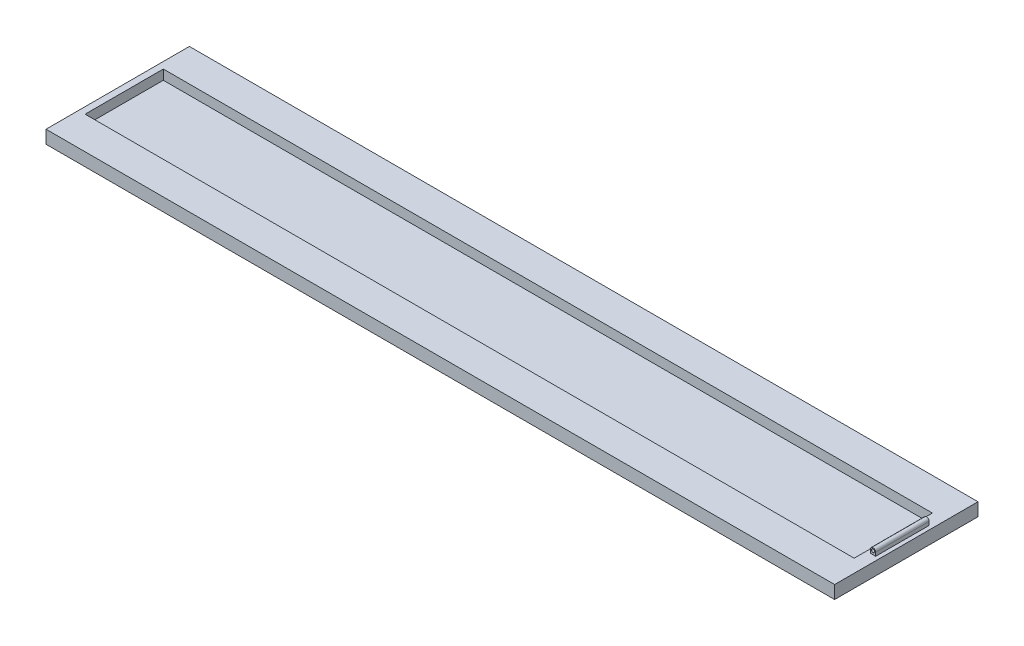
from build123d import *

# Parameters (mm, degrees)
ESQUISSE1_W             = 12100
ESQUISSE1_H             = 200
EXTRUSION1_DEPTH        = 1100
ESQUISSE2_R             = 25
EXTRUSION2_DEPTH        = 410
ESQUISSE3_W             = 11800
ESQUISSE3_H             = 1200
ENL_V_MAT_EXTRU_1_DEPTH = 150


with BuildPart() as part:
    # Esquisse1 → Extrusion1 (new, symmetric)
    with BuildSketch(Plane.XY):
        with Locations((-5950, -155)):
            Rectangle(ESQUISSE1_W, ESQUISSE1_H)
    extrude(amount=EXTRUSION1_DEPTH, both=True)

    # Esquisse2 → Extrusion2 (add, symmetric)
    with BuildSketch(Plane.XY):
        with BuildLine():
            Line((-40, 0), (-40, -55))
            Line((-40, -55), (40, -55))
            Line((40, -55), (40, 0))
            ThreePointArc((40, 0), (0, 40), (-40, 0))
        make_face()
        with Locations(Location((0, 0, 0), (0, 0, 180))):
            Circle(ESQUISSE2_R, mode=Mode.SUBTRACT)
    extrude(amount=EXTRUSION2_DEPTH, both=True)

    # Esquisse3 → Enl_v. mat.-Extru.1 (cut)
    with BuildSketch(Plane(origin=(0, -55, 0), x_dir=(1, 0, 0), z_dir=(0, 1, 0))):
        with Locations((-6000, 0)):
            Rectangle(ESQUISSE3_W, ESQUISSE3_H)
    extrude(amount=-ENL_V_MAT_EXTRU_1_DEPTH, mode=Mode.SUBTRACT)


solid = part.part
